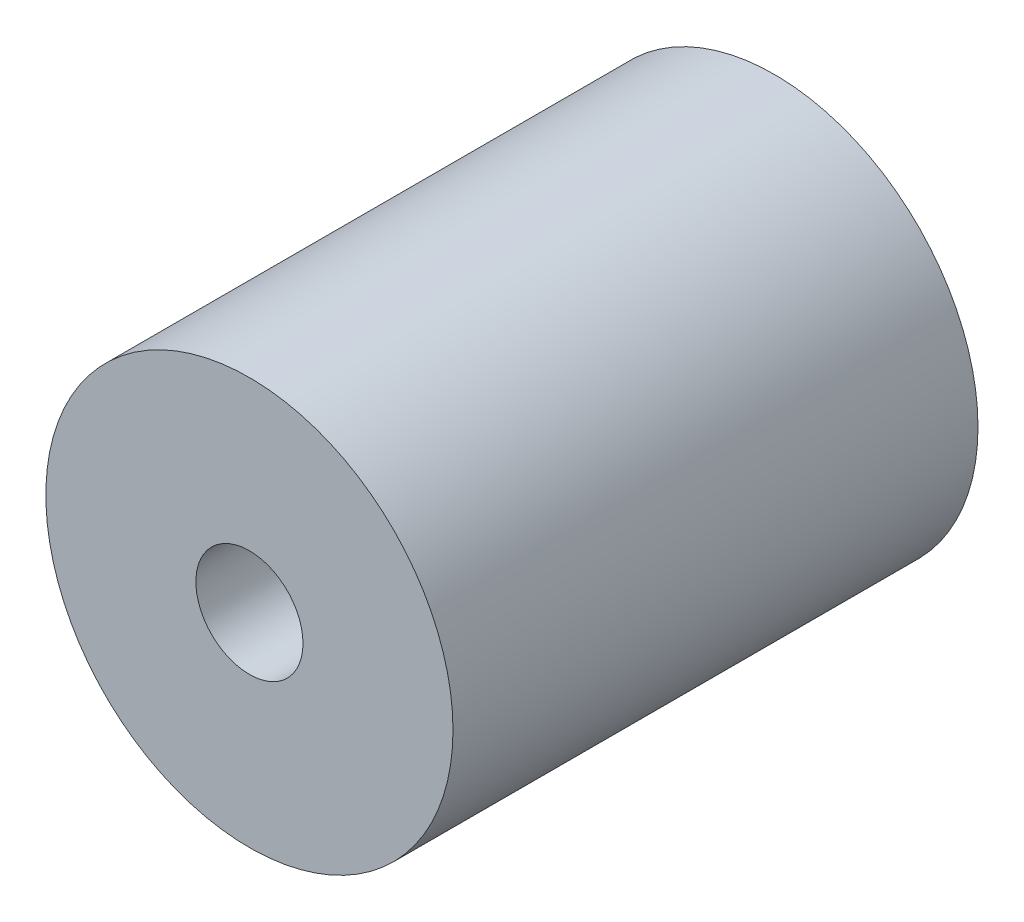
from build123d import *

# Parameters (mm, degrees)
SKIZZE1_R                       = 9.5
AUFSATZ_LINEAR_AUSTRAGEN1_DEPTH = 24.5
SKIZZE2_R                       = 2.5
SCHNITT_LINEAR_AUSTRAGEN1_DEPTH = 7
SCHNITT_LINEAR_START            = -7
SKIZZE3_R                       = 2.5
SCHNITT_LINEAR_AUSTRAGEN2_DEPTH = 7


with BuildPart() as part:
    # Skizze1 → Aufsatz-Linear austragen1 (new body)
    with BuildSketch(Plane.XY):
        Circle(SKIZZE1_R)
    extrude(amount=AUFSATZ_LINEAR_AUSTRAGEN1_DEPTH)

    # Skizze2 → Schnitt-Linear austragen1 (cut)
    with BuildSketch(Plane.XY.offset(24.5)):
        Circle(SKIZZE2_R)
    extrude(amount=-SCHNITT_LINEAR_AUSTRAGEN1_DEPTH, mode=Mode.SUBTRACT)

    # Skizze3 → Schnitt-Linear austragen2 (cut)
    with BuildSketch(Plane(origin=(0, 0, 0), x_dir=(-1, 0, 0), z_dir=(0, 0, -1)).offset(SCHNITT_LINEAR_START)):
        with Locations(Location((0, 0, 0), (0, 0, 180))):
            Circle(SKIZZE3_R)
    extrude(amount=SCHNITT_LINEAR_AUSTRAGEN2_DEPTH, mode=Mode.SUBTRACT)


solid = part.part
